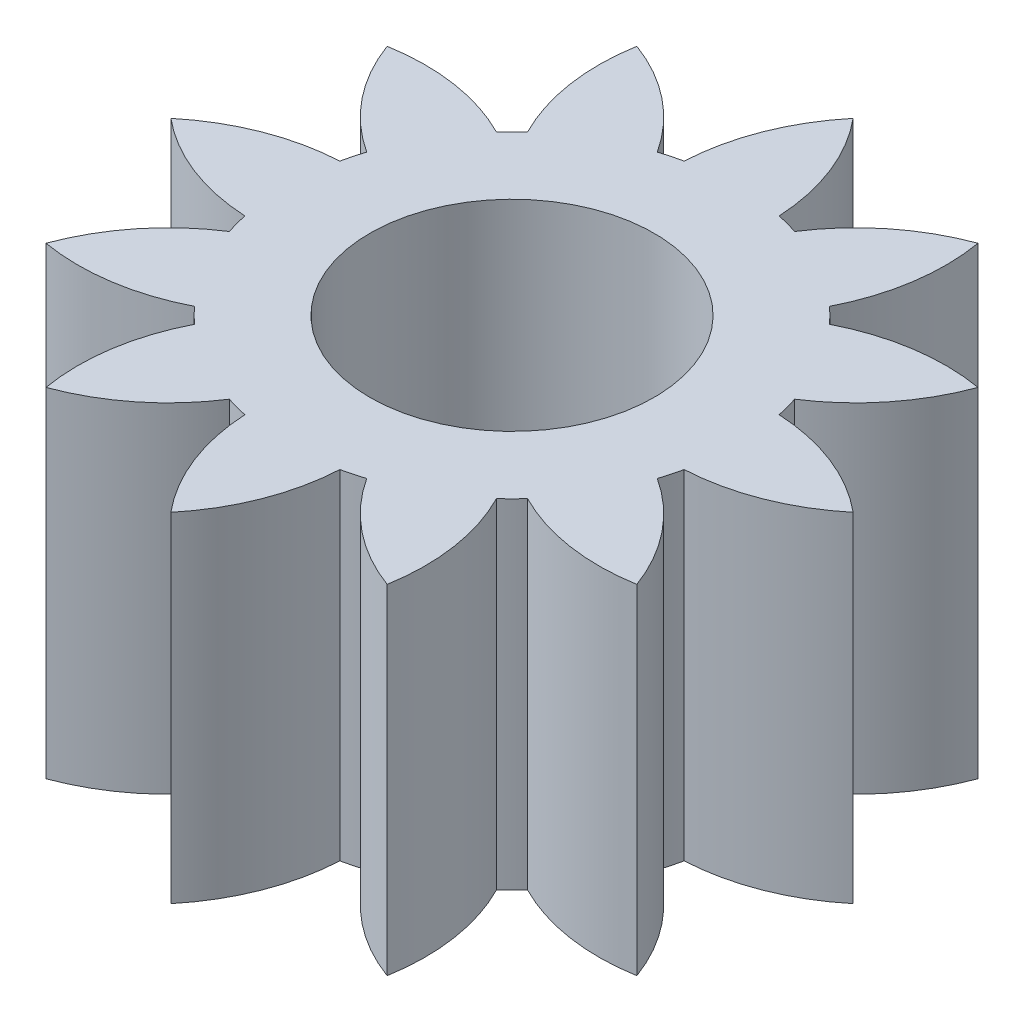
ISO-10303-21;
HEADER;
FILE_DESCRIPTION(('STEP AP214'),'2;1');
FILE_NAME('part.step','',(''),(''),'','','');
FILE_SCHEMA(('AUTOMOTIVE_DESIGN { 1 0 10303 214 1 1 1 1 }'));
ENDSEC;
DATA;
#1=APPLICATION_CONTEXT('core data for automotive mechanical design processes');
#2=APPLICATION_PROTOCOL_DEFINITION('international standard','automotive_design',2000,#1);
#3=PRODUCT_CONTEXT('',#1,'mechanical');
#4=PRODUCT('Part','Part','',(#3));
#5=PRODUCT_RELATED_PRODUCT_CATEGORY('part','',(#4));
#6=PRODUCT_DEFINITION_FORMATION('','',#4);
#7=PRODUCT_DEFINITION_CONTEXT('part definition',#1,'design');
#8=PRODUCT_DEFINITION('design','',#6,#7);
#9=PRODUCT_DEFINITION_SHAPE('','',#8);
#10=(LENGTH_UNIT() NAMED_UNIT(*) SI_UNIT(.MILLI.,.METRE.));
#11=(NAMED_UNIT(*) PLANE_ANGLE_UNIT() SI_UNIT($,.RADIAN.));
#12=(NAMED_UNIT(*) SI_UNIT($,.STERADIAN.) SOLID_ANGLE_UNIT());
#13=UNCERTAINTY_MEASURE_WITH_UNIT(LENGTH_MEASURE(1.E-05),#10,'distance_accuracy_value','');
#14=(GEOMETRIC_REPRESENTATION_CONTEXT(3) GLOBAL_UNCERTAINTY_ASSIGNED_CONTEXT((#13)) GLOBAL_UNIT_ASSIGNED_CONTEXT((#10,
#11,#12)) REPRESENTATION_CONTEXT('',''));
#15=CARTESIAN_POINT('',(0.,0.,0.));
#16=DIRECTION('',(0.,0.,1.));
#17=DIRECTION('',(1.,0.,0.));
#18=AXIS2_PLACEMENT_3D('',#15,#16,#17);
#19=CARTESIAN_POINT('',(0.,5.842,0.));
#20=DIRECTION('',(0.,-1.,0.));
#21=DIRECTION('',(0.,0.,-1.));
#22=AXIS2_PLACEMENT_3D('',#19,#20,#21);
#23=CYLINDRICAL_SURFACE('',#22,3.8735);
#24=DIRECTION('',(0.,-1.,0.));
#25=VECTOR('',#24,1.);
#26=CARTESIAN_POINT('',(-2.60173430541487,8.70671709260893,-2.86966563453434));
#27=LINE('',#26,#25);
#28=CARTESIAN_POINT('',(-2.60173430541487,5.842,-2.86966563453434));
#29=VERTEX_POINT('',#28);
#30=CARTESIAN_POINT('',(-2.60173430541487,0.,-2.86966563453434));
#31=VERTEX_POINT('',#30);
#32=EDGE_CURVE('E296',#29,#31,#27,.T.);
#33=ORIENTED_EDGE('',*,*,#32,.T.);
#34=CARTESIAN_POINT('',(0.,0.,0.));
#35=DIRECTION('',(0.,1.,0.));
#36=DIRECTION('',(0.,0.,1.));
#37=AXIS2_PLACEMENT_3D('',#34,#35,#36);
#38=CIRCLE('',#37,3.8735);
#39=CARTESIAN_POINT('',(-2.86966563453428,0.,-2.60173430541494));
#40=VERTEX_POINT('',#39);
#41=EDGE_CURVE('E661',#31,#40,#38,.T.);
#42=ORIENTED_EDGE('',*,*,#41,.T.);
#43=DIRECTION('',(0.,-1.,0.));
#44=VECTOR('',#43,1.);
#45=CARTESIAN_POINT('',(-2.86966563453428,8.70671709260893,-2.60173430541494));
#46=LINE('',#45,#44);
#47=CARTESIAN_POINT('',(-2.86966563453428,5.842,-2.60173430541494));
#48=VERTEX_POINT('',#47);
#49=EDGE_CURVE('E316',#48,#40,#46,.T.);
#50=ORIENTED_EDGE('',*,*,#49,.F.);
#51=CARTESIAN_POINT('',(0.,5.842,0.));
#52=DIRECTION('',(0.,1.,0.));
#53=DIRECTION('',(0.,0.,1.));
#54=AXIS2_PLACEMENT_3D('',#51,#52,#53);
#55=CIRCLE('',#54,3.8735);
#56=EDGE_CURVE('E53',#29,#48,#55,.T.);
#57=ORIENTED_EDGE('',*,*,#56,.F.);
#58=EDGE_LOOP('',(#33,#42,#50,#57));
#59=FACE_BOUND('',#58,.T.);
#60=ADVANCED_FACE('F43',(#59),#23,.T.);
#61=DIRECTION('',(0.,-1.,0.));
#62=VECTOR('',#61,1.);
#63=CARTESIAN_POINT('',(-1.1843361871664,8.70671709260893,-3.68800081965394));
#64=LINE('',#63,#62);
#65=CARTESIAN_POINT('',(-1.1843361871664,5.842,-3.68800081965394));
#66=VERTEX_POINT('',#65);
#67=CARTESIAN_POINT('',(-1.1843361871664,0.,-3.68800081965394));
#68=VERTEX_POINT('',#67);
#69=EDGE_CURVE('E68',#66,#68,#64,.T.);
#70=ORIENTED_EDGE('',*,*,#69,.F.);
#71=CARTESIAN_POINT('',(-0.818335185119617,5.842,-3.78607049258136));
#72=VERTEX_POINT('',#71);
#73=EDGE_CURVE('E11',#72,#66,#55,.T.);
#74=ORIENTED_EDGE('',*,*,#73,.F.);
#75=DIRECTION('',(0.,-1.,0.));
#76=VECTOR('',#75,1.);
#77=CARTESIAN_POINT('',(-0.818335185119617,8.70671709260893,-3.78607049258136));
#78=LINE('',#77,#76);
#79=CARTESIAN_POINT('',(-0.818335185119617,0.,-3.78607049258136));
#80=VERTEX_POINT('',#79);
#81=EDGE_CURVE('E584',#72,#80,#78,.T.);
#82=ORIENTED_EDGE('',*,*,#81,.T.);
#83=EDGE_CURVE('E47',#80,#68,#38,.T.);
#84=ORIENTED_EDGE('',*,*,#83,.T.);
#85=EDGE_LOOP('',(#70,#74,#82,#84));
#86=FACE_BOUND('',#85,.T.);
#87=ADVANCED_FACE('F632',(#86),#23,.T.);
#88=DIRECTION('',(0.,-1.,0.));
#89=VECTOR('',#88,1.);
#90=CARTESIAN_POINT('',(-3.68800081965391,8.70671709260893,-1.18433618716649));
#91=LINE('',#90,#89);
#92=CARTESIAN_POINT('',(-3.68800081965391,5.842,-1.18433618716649));
#93=VERTEX_POINT('',#92);
#94=CARTESIAN_POINT('',(-3.68800081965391,0.,-1.18433618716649));
#95=VERTEX_POINT('',#94);
#96=EDGE_CURVE('E320',#93,#95,#91,.T.);
#97=ORIENTED_EDGE('',*,*,#96,.T.);
#98=CARTESIAN_POINT('',(-3.78607049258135,0.,-0.818335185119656));
#99=VERTEX_POINT('',#98);
#100=EDGE_CURVE('E665',#95,#99,#38,.T.);
#101=ORIENTED_EDGE('',*,*,#100,.T.);
#102=DIRECTION('',(0.,-1.,0.));
#103=VECTOR('',#102,1.);
#104=CARTESIAN_POINT('',(-3.78607049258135,8.70671709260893,-0.818335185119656));
#105=LINE('',#104,#103);
#106=CARTESIAN_POINT('',(-3.78607049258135,5.842,-0.818335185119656));
#107=VERTEX_POINT('',#106);
#108=EDGE_CURVE('E343',#107,#99,#105,.T.);
#109=ORIENTED_EDGE('',*,*,#108,.F.);
#110=EDGE_CURVE('E731',#93,#107,#55,.T.);
#111=ORIENTED_EDGE('',*,*,#110,.F.);
#112=EDGE_LOOP('',(#97,#101,#109,#111));
#113=FACE_BOUND('',#112,.T.);
#114=ADVANCED_FACE('F636',(#113),#23,.T.);
#115=DIRECTION('',(0.,-1.,0.));
#116=VECTOR('',#115,1.);
#117=CARTESIAN_POINT('',(-3.78607049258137,8.70671709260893,0.818335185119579));
#118=LINE('',#117,#116);
#119=CARTESIAN_POINT('',(-3.78607049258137,5.842,0.818335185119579));
#120=VERTEX_POINT('',#119);
#121=CARTESIAN_POINT('',(-3.78607049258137,0.,0.818335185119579));
#122=VERTEX_POINT('',#121);
#123=EDGE_CURVE('E347',#120,#122,#118,.T.);
#124=ORIENTED_EDGE('',*,*,#123,.T.);
#125=CARTESIAN_POINT('',(-3.68800081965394,0.,1.18433618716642));
#126=VERTEX_POINT('',#125);
#127=EDGE_CURVE('E667',#122,#126,#38,.T.);
#128=ORIENTED_EDGE('',*,*,#127,.T.);
#129=DIRECTION('',(0.,-1.,0.));
#130=VECTOR('',#129,1.);
#131=CARTESIAN_POINT('',(-3.68800081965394,8.70671709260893,1.18433618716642));
#132=LINE('',#131,#130);
#133=CARTESIAN_POINT('',(-3.68800081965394,5.842,1.18433618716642));
#134=VERTEX_POINT('',#133);
#135=EDGE_CURVE('E370',#134,#126,#132,.T.);
#136=ORIENTED_EDGE('',*,*,#135,.F.);
#137=EDGE_CURVE('E733',#120,#134,#55,.T.);
#138=ORIENTED_EDGE('',*,*,#137,.F.);
#139=EDGE_LOOP('',(#124,#128,#136,#138));
#140=FACE_BOUND('',#139,.T.);
#141=ADVANCED_FACE('F801',(#140),#23,.T.);
#142=DIRECTION('',(0.,-1.,0.));
#143=VECTOR('',#142,1.);
#144=CARTESIAN_POINT('',(-2.86966563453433,8.70671709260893,2.60173430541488));
#145=LINE('',#144,#143);
#146=CARTESIAN_POINT('',(-2.86966563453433,5.842,2.60173430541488));
#147=VERTEX_POINT('',#146);
#148=CARTESIAN_POINT('',(-2.86966563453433,0.,2.60173430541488));
#149=VERTEX_POINT('',#148);
#150=EDGE_CURVE('E374',#147,#149,#145,.T.);
#151=ORIENTED_EDGE('',*,*,#150,.T.);
#152=CARTESIAN_POINT('',(-2.60173430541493,0.,2.86966563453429));
#153=VERTEX_POINT('',#152);
#154=EDGE_CURVE('E671',#149,#153,#38,.T.);
#155=ORIENTED_EDGE('',*,*,#154,.T.);
#156=DIRECTION('',(0.,-1.,0.));
#157=VECTOR('',#156,1.);
#158=CARTESIAN_POINT('',(-2.60173430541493,8.70671709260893,2.86966563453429));
#159=LINE('',#158,#157);
#160=CARTESIAN_POINT('',(-2.60173430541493,5.842,2.86966563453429));
#161=VERTEX_POINT('',#160);
#162=EDGE_CURVE('E397',#161,#153,#159,.T.);
#163=ORIENTED_EDGE('',*,*,#162,.F.);
#164=EDGE_CURVE('E735',#147,#161,#55,.T.);
#165=ORIENTED_EDGE('',*,*,#164,.F.);
#166=EDGE_LOOP('',(#151,#155,#163,#165));
#167=FACE_BOUND('',#166,.T.);
#168=ADVANCED_FACE('F791',(#167),#23,.T.);
#169=DIRECTION('',(0.,-1.,0.));
#170=VECTOR('',#169,1.);
#171=CARTESIAN_POINT('',(-1.18433618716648,8.70671709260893,3.68800081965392));
#172=LINE('',#171,#170);
#173=CARTESIAN_POINT('',(-1.18433618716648,5.842,3.68800081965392));
#174=VERTEX_POINT('',#173);
#175=CARTESIAN_POINT('',(-1.18433618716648,0.,3.68800081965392));
#176=VERTEX_POINT('',#175);
#177=EDGE_CURVE('E401',#174,#176,#172,.T.);
#178=ORIENTED_EDGE('',*,*,#177,.T.);
#179=CARTESIAN_POINT('',(-0.818335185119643,0.,3.78607049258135));
#180=VERTEX_POINT('',#179);
#181=EDGE_CURVE('E675',#176,#180,#38,.T.);
#182=ORIENTED_EDGE('',*,*,#181,.T.);
#183=DIRECTION('',(0.,-1.,0.));
#184=VECTOR('',#183,1.);
#185=CARTESIAN_POINT('',(-0.818335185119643,8.70671709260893,3.78607049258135));
#186=LINE('',#185,#184);
#187=CARTESIAN_POINT('',(-0.818335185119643,5.842,3.78607049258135));
#188=VERTEX_POINT('',#187);
#189=EDGE_CURVE('E424',#188,#180,#186,.T.);
#190=ORIENTED_EDGE('',*,*,#189,.F.);
#191=EDGE_CURVE('E737',#174,#188,#55,.T.);
#192=ORIENTED_EDGE('',*,*,#191,.F.);
#193=EDGE_LOOP('',(#178,#182,#190,#192));
#194=FACE_BOUND('',#193,.T.);
#195=ADVANCED_FACE('F781',(#194),#23,.T.);
#196=DIRECTION('',(0.,-1.,0.));
#197=VECTOR('',#196,1.);
#198=CARTESIAN_POINT('',(0.818335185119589,8.70671709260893,3.78607049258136));
#199=LINE('',#198,#197);
#200=CARTESIAN_POINT('',(0.818335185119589,5.842,3.78607049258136));
#201=VERTEX_POINT('',#200);
#202=CARTESIAN_POINT('',(0.818335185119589,0.,3.78607049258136));
#203=VERTEX_POINT('',#202);
#204=EDGE_CURVE('E428',#201,#203,#199,.T.);
#205=ORIENTED_EDGE('',*,*,#204,.T.);
#206=CARTESIAN_POINT('',(1.18433618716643,0.,3.68800081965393));
#207=VERTEX_POINT('',#206);
#208=EDGE_CURVE('E679',#203,#207,#38,.T.);
#209=ORIENTED_EDGE('',*,*,#208,.T.);
#210=DIRECTION('',(0.,-1.,0.));
#211=VECTOR('',#210,1.);
#212=CARTESIAN_POINT('',(1.18433618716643,8.70671709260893,3.68800081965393));
#213=LINE('',#212,#211);
#214=CARTESIAN_POINT('',(1.18433618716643,5.842,3.68800081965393));
#215=VERTEX_POINT('',#214);
#216=EDGE_CURVE('E451',#215,#207,#213,.T.);
#217=ORIENTED_EDGE('',*,*,#216,.F.);
#218=EDGE_CURVE('E739',#201,#215,#55,.T.);
#219=ORIENTED_EDGE('',*,*,#218,.F.);
#220=EDGE_LOOP('',(#205,#209,#217,#219));
#221=FACE_BOUND('',#220,.T.);
#222=ADVANCED_FACE('F771',(#221),#23,.T.);
#223=DIRECTION('',(0.,-1.,0.));
#224=VECTOR('',#223,1.);
#225=CARTESIAN_POINT('',(2.60173430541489,8.70671709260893,2.86966563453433));
#226=LINE('',#225,#224);
#227=CARTESIAN_POINT('',(2.60173430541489,5.842,2.86966563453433));
#228=VERTEX_POINT('',#227);
#229=CARTESIAN_POINT('',(2.60173430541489,0.,2.86966563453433));
#230=VERTEX_POINT('',#229);
#231=EDGE_CURVE('E455',#228,#230,#226,.T.);
#232=ORIENTED_EDGE('',*,*,#231,.T.);
#233=CARTESIAN_POINT('',(2.8696656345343,0.,2.60173430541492));
#234=VERTEX_POINT('',#233);
#235=EDGE_CURVE('E683',#230,#234,#38,.T.);
#236=ORIENTED_EDGE('',*,*,#235,.T.);
#237=DIRECTION('',(0.,-1.,0.));
#238=VECTOR('',#237,1.);
#239=CARTESIAN_POINT('',(2.8696656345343,8.70671709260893,2.60173430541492));
#240=LINE('',#239,#238);
#241=CARTESIAN_POINT('',(2.8696656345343,5.842,2.60173430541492));
#242=VERTEX_POINT('',#241);
#243=EDGE_CURVE('E478',#242,#234,#240,.T.);
#244=ORIENTED_EDGE('',*,*,#243,.F.);
#245=EDGE_CURVE('E713',#228,#242,#55,.T.);
#246=ORIENTED_EDGE('',*,*,#245,.F.);
#247=EDGE_LOOP('',(#232,#236,#244,#246));
#248=FACE_BOUND('',#247,.T.);
#249=ADVANCED_FACE('F745',(#248),#23,.T.);
#250=DIRECTION('',(0.,-1.,0.));
#251=VECTOR('',#250,1.);
#252=CARTESIAN_POINT('',(3.68800081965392,8.70671709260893,1.18433618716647));
#253=LINE('',#252,#251);
#254=CARTESIAN_POINT('',(3.68800081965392,5.842,1.18433618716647));
#255=VERTEX_POINT('',#254);
#256=CARTESIAN_POINT('',(3.68800081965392,0.,1.18433618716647));
#257=VERTEX_POINT('',#256);
#258=EDGE_CURVE('E482',#255,#257,#253,.T.);
#259=ORIENTED_EDGE('',*,*,#258,.T.);
#260=CARTESIAN_POINT('',(3.78607049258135,0.,0.818335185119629));
#261=VERTEX_POINT('',#260);
#262=EDGE_CURVE('E687',#257,#261,#38,.T.);
#263=ORIENTED_EDGE('',*,*,#262,.T.);
#264=DIRECTION('',(0.,-1.,0.));
#265=VECTOR('',#264,1.);
#266=CARTESIAN_POINT('',(3.78607049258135,8.70671709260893,0.81833518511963));
#267=LINE('',#266,#265);
#268=CARTESIAN_POINT('',(3.78607049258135,5.842,0.818335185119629));
#269=VERTEX_POINT('',#268);
#270=EDGE_CURVE('E505',#269,#261,#267,.T.);
#271=ORIENTED_EDGE('',*,*,#270,.F.);
#272=EDGE_CURVE('E710',#255,#269,#55,.T.);
#273=ORIENTED_EDGE('',*,*,#272,.F.);
#274=EDGE_LOOP('',(#259,#263,#271,#273));
#275=FACE_BOUND('',#274,.T.);
#276=ADVANCED_FACE('F755',(#275),#23,.T.);
#277=DIRECTION('',(0.,-1.,0.));
#278=VECTOR('',#277,1.);
#279=CARTESIAN_POINT('',(3.78607049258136,8.70671709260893,-0.818335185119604));
#280=LINE('',#279,#278);
#281=CARTESIAN_POINT('',(3.78607049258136,5.842,-0.818335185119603));
#282=VERTEX_POINT('',#281);
#283=CARTESIAN_POINT('',(3.78607049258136,0.,-0.818335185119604));
#284=VERTEX_POINT('',#283);
#285=EDGE_CURVE('E509',#282,#284,#280,.T.);
#286=ORIENTED_EDGE('',*,*,#285,.T.);
#287=CARTESIAN_POINT('',(3.68800081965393,0.,-1.18433618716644));
#288=VERTEX_POINT('',#287);
#289=EDGE_CURVE('E659',#284,#288,#38,.T.);
#290=ORIENTED_EDGE('',*,*,#289,.T.);
#291=DIRECTION('',(0.,-1.,0.));
#292=VECTOR('',#291,1.);
#293=CARTESIAN_POINT('',(3.68800081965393,8.70671709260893,-1.18433618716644));
#294=LINE('',#293,#292);
#295=CARTESIAN_POINT('',(3.68800081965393,5.842,-1.18433618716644));
#296=VERTEX_POINT('',#295);
#297=EDGE_CURVE('E532',#296,#288,#294,.T.);
#298=ORIENTED_EDGE('',*,*,#297,.F.);
#299=EDGE_CURVE('E707',#282,#296,#55,.T.);
#300=ORIENTED_EDGE('',*,*,#299,.F.);
#301=EDGE_LOOP('',(#286,#290,#298,#300));
#302=FACE_BOUND('',#301,.T.);
#303=ADVANCED_FACE('F644',(#302),#23,.T.);
#304=DIRECTION('',(0.,-1.,0.));
#305=VECTOR('',#304,1.);
#306=CARTESIAN_POINT('',(2.86966563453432,8.70671709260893,-2.6017343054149));
#307=LINE('',#306,#305);
#308=CARTESIAN_POINT('',(2.86966563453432,5.842,-2.6017343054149));
#309=VERTEX_POINT('',#308);
#310=CARTESIAN_POINT('',(2.86966563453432,0.,-2.6017343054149));
#311=VERTEX_POINT('',#310);
#312=EDGE_CURVE('E536',#309,#311,#307,.T.);
#313=ORIENTED_EDGE('',*,*,#312,.T.);
#314=CARTESIAN_POINT('',(2.60173430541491,0.,-2.86966563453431));
#315=VERTEX_POINT('',#314);
#316=EDGE_CURVE('E657',#311,#315,#38,.T.);
#317=ORIENTED_EDGE('',*,*,#316,.T.);
#318=DIRECTION('',(0.,-1.,0.));
#319=VECTOR('',#318,1.);
#320=CARTESIAN_POINT('',(2.60173430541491,8.70671709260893,-2.86966563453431));
#321=LINE('',#320,#319);
#322=CARTESIAN_POINT('',(2.60173430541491,5.842,-2.86966563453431));
#323=VERTEX_POINT('',#322);
#324=EDGE_CURVE('E559',#323,#315,#321,.T.);
#325=ORIENTED_EDGE('',*,*,#324,.F.);
#326=EDGE_CURVE('E664',#309,#323,#55,.T.);
#327=ORIENTED_EDGE('',*,*,#326,.F.);
#328=EDGE_LOOP('',(#313,#317,#325,#327));
#329=FACE_BOUND('',#328,.T.);
#330=ADVANCED_FACE('F638',(#329),#23,.T.);
#331=DIRECTION('',(0.,-1.,0.));
#332=VECTOR('',#331,1.);
#333=CARTESIAN_POINT('',(1.18433618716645,8.70671709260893,-3.68800081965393));
#334=LINE('',#333,#332);
#335=CARTESIAN_POINT('',(1.18433618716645,5.842,-3.68800081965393));
#336=VERTEX_POINT('',#335);
#337=CARTESIAN_POINT('',(1.18433618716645,0.,-3.68800081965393));
#338=VERTEX_POINT('',#337);
#339=EDGE_CURVE('E563',#336,#338,#334,.T.);
#340=ORIENTED_EDGE('',*,*,#339,.T.);
#341=CARTESIAN_POINT('',(0.818335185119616,0.,-3.78607049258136));
#342=VERTEX_POINT('',#341);
#343=EDGE_CURVE('E610',#338,#342,#38,.T.);
#344=ORIENTED_EDGE('',*,*,#343,.T.);
#345=DIRECTION('',(0.,-1.,0.));
#346=VECTOR('',#345,1.);
#347=CARTESIAN_POINT('',(0.818335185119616,8.70671709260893,-3.78607049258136));
#348=LINE('',#347,#346);
#349=CARTESIAN_POINT('',(0.818335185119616,5.842,-3.78607049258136));
#350=VERTEX_POINT('',#349);
#351=EDGE_CURVE('E557',#350,#342,#348,.T.);
#352=ORIENTED_EDGE('',*,*,#351,.F.);
#353=EDGE_CURVE('E54',#336,#350,#55,.T.);
#354=ORIENTED_EDGE('',*,*,#353,.F.);
#355=EDGE_LOOP('',(#340,#344,#352,#354));
#356=FACE_BOUND('',#355,.T.);
#357=ADVANCED_FACE('F45',(#356),#23,.T.);
#358=CARTESIAN_POINT('',(0.,5.842,0.));
#359=DIRECTION('',(0.,1.,0.));
#360=DIRECTION('',(0.,0.,1.));
#361=AXIS2_PLACEMENT_3D('',#358,#359,#360);
#362=PLANE('',#361);
#363=ORIENTED_EDGE('',*,*,#73,.T.);
#364=CARTESIAN_POINT('',(-4.1694580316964,5.842,-1.75559724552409));
#365=DIRECTION('',(0.,1.,0.));
#366=DIRECTION('',(0.,0.,1.));
#367=AXIS2_PLACEMENT_3D('',#364,#365,#366);
#368=CIRCLE('',#367,3.556);
#369=CARTESIAN_POINT('',(-2.94004999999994,5.842,-5.09231597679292));
#370=VERTEX_POINT('',#369);
#371=EDGE_CURVE('E283',#66,#370,#368,.T.);
#372=ORIENTED_EDGE('',*,*,#371,.T.);
#373=CARTESIAN_POINT('',(0.564337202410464,5.842,-4.48865519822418));
#374=DIRECTION('',(0.,1.,0.));
#375=DIRECTION('',(0.,0.,1.));
#376=AXIS2_PLACEMENT_3D('',#373,#374,#375);
#377=CIRCLE('',#376,3.556);
#378=EDGE_CURVE('E294',#370,#29,#377,.T.);
#379=ORIENTED_EDGE('',*,*,#378,.T.);
#380=ORIENTED_EDGE('',*,*,#56,.T.);
#381=CARTESIAN_POINT('',(-4.48865519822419,5.842,0.564337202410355));
#382=DIRECTION('',(0.,1.,0.));
#383=DIRECTION('',(0.,0.,1.));
#384=AXIS2_PLACEMENT_3D('',#381,#382,#383);
#385=CIRCLE('',#384,3.556);
#386=CARTESIAN_POINT('',(-5.09231597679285,5.842,-2.94005000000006));
#387=VERTEX_POINT('',#386);
#388=EDGE_CURVE('E325',#48,#387,#385,.T.);
#389=ORIENTED_EDGE('',*,*,#388,.T.);
#390=CARTESIAN_POINT('',(-1.75559724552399,5.842,-4.16945803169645));
#391=DIRECTION('',(0.,1.,0.));
#392=DIRECTION('',(0.,0.,1.));
#393=AXIS2_PLACEMENT_3D('',#390,#391,#392);
#394=CIRCLE('',#393,3.556);
#395=EDGE_CURVE('E290',#387,#93,#394,.T.);
#396=ORIENTED_EDGE('',*,*,#395,.T.);
#397=ORIENTED_EDGE('',*,*,#110,.T.);
#398=CARTESIAN_POINT('',(-3.60512082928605,5.842,2.73305795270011));
#399=DIRECTION('',(0.,1.,0.));
#400=DIRECTION('',(0.,0.,1.));
#401=AXIS2_PLACEMENT_3D('',#398,#399,#400);
#402=CIRCLE('',#401,3.556);
#403=CARTESIAN_POINT('',(-5.8801,5.842,0.));
#404=VERTEX_POINT('',#403);
#405=EDGE_CURVE('E352',#107,#404,#402,.T.);
#406=ORIENTED_EDGE('',*,*,#405,.T.);
#407=CARTESIAN_POINT('',(-3.60512082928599,5.842,-2.73305795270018));
#408=DIRECTION('',(0.,1.,0.));
#409=DIRECTION('',(0.,0.,1.));
#410=AXIS2_PLACEMENT_3D('',#407,#408,#409);
#411=CIRCLE('',#410,3.556);
#412=EDGE_CURVE('E314',#404,#120,#411,.T.);
#413=ORIENTED_EDGE('',*,*,#412,.T.);
#414=ORIENTED_EDGE('',*,*,#137,.T.);
#415=CARTESIAN_POINT('',(-1.75559724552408,5.842,4.16945803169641));
#416=DIRECTION('',(0.,1.,0.));
#417=DIRECTION('',(0.,0.,1.));
#418=AXIS2_PLACEMENT_3D('',#415,#416,#417);
#419=CIRCLE('',#418,3.556);
#420=CARTESIAN_POINT('',(-5.09231597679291,5.842,2.94004999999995));
#421=VERTEX_POINT('',#420);
#422=EDGE_CURVE('E379',#134,#421,#419,.T.);
#423=ORIENTED_EDGE('',*,*,#422,.T.);
#424=CARTESIAN_POINT('',(-4.48865519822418,5.842,-0.564337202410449));
#425=DIRECTION('',(0.,1.,0.));
#426=DIRECTION('',(0.,0.,1.));
#427=AXIS2_PLACEMENT_3D('',#424,#425,#426);
#428=CIRCLE('',#427,3.556);
#429=EDGE_CURVE('E341',#421,#147,#428,.T.);
#430=ORIENTED_EDGE('',*,*,#429,.T.);
#431=ORIENTED_EDGE('',*,*,#164,.T.);
#432=CARTESIAN_POINT('',(0.56433720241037,5.842,4.48865519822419));
#433=DIRECTION('',(0.,1.,0.));
#434=DIRECTION('',(0.,0.,1.));
#435=AXIS2_PLACEMENT_3D('',#432,#433,#434);
#436=CIRCLE('',#435,3.556);
#437=CARTESIAN_POINT('',(-2.94005000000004,5.842,5.09231597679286));
#438=VERTEX_POINT('',#437);
#439=EDGE_CURVE('E406',#161,#438,#436,.T.);
#440=ORIENTED_EDGE('',*,*,#439,.T.);
#441=CARTESIAN_POINT('',(-4.16945803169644,5.842,1.755597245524));
#442=DIRECTION('',(0.,1.,0.));
#443=DIRECTION('',(0.,0.,1.));
#444=AXIS2_PLACEMENT_3D('',#441,#442,#443);
#445=CIRCLE('',#444,3.556);
#446=EDGE_CURVE('E368',#438,#174,#445,.T.);
#447=ORIENTED_EDGE('',*,*,#446,.T.);
#448=ORIENTED_EDGE('',*,*,#191,.T.);
#449=CARTESIAN_POINT('',(2.73305795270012,5.842,3.60512082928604));
#450=DIRECTION('',(0.,1.,0.));
#451=DIRECTION('',(0.,0.,1.));
#452=AXIS2_PLACEMENT_3D('',#449,#450,#451);
#453=CIRCLE('',#452,3.556);
#454=CARTESIAN_POINT('',(0.,5.842,5.8801));
#455=VERTEX_POINT('',#454);
#456=EDGE_CURVE('E433',#188,#455,#453,.T.);
#457=ORIENTED_EDGE('',*,*,#456,.T.);
#458=CARTESIAN_POINT('',(-2.73305795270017,5.842,3.605120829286));
#459=DIRECTION('',(0.,1.,0.));
#460=DIRECTION('',(0.,0.,1.));
#461=AXIS2_PLACEMENT_3D('',#458,#459,#460);
#462=CIRCLE('',#461,3.556);
#463=EDGE_CURVE('E395',#455,#201,#462,.T.);
#464=ORIENTED_EDGE('',*,*,#463,.T.);
#465=ORIENTED_EDGE('',*,*,#218,.T.);
#466=CARTESIAN_POINT('',(4.16945803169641,5.842,1.75559724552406));
#467=DIRECTION('',(0.,1.,0.));
#468=DIRECTION('',(0.,0.,1.));
#469=AXIS2_PLACEMENT_3D('',#466,#467,#468);
#470=CIRCLE('',#469,3.556);
#471=CARTESIAN_POINT('',(2.94004999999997,5.842,5.0923159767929));
#472=VERTEX_POINT('',#471);
#473=EDGE_CURVE('E460',#215,#472,#470,.T.);
#474=ORIENTED_EDGE('',*,*,#473,.T.);
#475=CARTESIAN_POINT('',(-0.564337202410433,5.842,4.48865519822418));
#476=DIRECTION('',(0.,1.,0.));
#477=DIRECTION('',(0.,0.,1.));
#478=AXIS2_PLACEMENT_3D('',#475,#476,#477);
#479=CIRCLE('',#478,3.556);
#480=EDGE_CURVE('E422',#472,#228,#479,.T.);
#481=ORIENTED_EDGE('',*,*,#480,.T.);
#482=ORIENTED_EDGE('',*,*,#245,.T.);
#483=CARTESIAN_POINT('',(4.48865519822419,5.842,-0.564337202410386));
#484=DIRECTION('',(0.,1.,0.));
#485=DIRECTION('',(0.,0.,1.));
#486=AXIS2_PLACEMENT_3D('',#483,#484,#485);
#487=CIRCLE('',#486,3.556);
#488=CARTESIAN_POINT('',(5.09231597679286,5.842,2.94005000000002));
#489=VERTEX_POINT('',#488);
#490=EDGE_CURVE('E487',#242,#489,#487,.T.);
#491=ORIENTED_EDGE('',*,*,#490,.T.);
#492=CARTESIAN_POINT('',(1.75559724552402,5.842,4.16945803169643));
#493=DIRECTION('',(0.,1.,0.));
#494=DIRECTION('',(0.,0.,1.));
#495=AXIS2_PLACEMENT_3D('',#492,#493,#494);
#496=CIRCLE('',#495,3.556);
#497=EDGE_CURVE('E449',#489,#255,#496,.T.);
#498=ORIENTED_EDGE('',*,*,#497,.T.);
#499=ORIENTED_EDGE('',*,*,#272,.T.);
#500=CARTESIAN_POINT('',(3.60512082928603,5.842,-2.73305795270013));
#501=DIRECTION('',(0.,1.,0.));
#502=DIRECTION('',(0.,0.,1.));
#503=AXIS2_PLACEMENT_3D('',#500,#501,#502);
#504=CIRCLE('',#503,3.556);
#505=CARTESIAN_POINT('',(5.8801,5.842,0.));
#506=VERTEX_POINT('',#505);
#507=EDGE_CURVE('E514',#269,#506,#504,.T.);
#508=ORIENTED_EDGE('',*,*,#507,.T.);
#509=CARTESIAN_POINT('',(3.60512082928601,5.842,2.73305795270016));
#510=DIRECTION('',(0.,1.,0.));
#511=DIRECTION('',(0.,0.,1.));
#512=AXIS2_PLACEMENT_3D('',#509,#510,#511);
#513=CIRCLE('',#512,3.556);
#514=EDGE_CURVE('E476',#506,#282,#513,.T.);
#515=ORIENTED_EDGE('',*,*,#514,.T.);
#516=ORIENTED_EDGE('',*,*,#299,.T.);
#517=CARTESIAN_POINT('',(1.75559724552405,5.842,-4.16945803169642));
#518=DIRECTION('',(0.,1.,0.));
#519=DIRECTION('',(0.,0.,1.));
#520=AXIS2_PLACEMENT_3D('',#517,#518,#519);
#521=CIRCLE('',#520,3.556);
#522=CARTESIAN_POINT('',(5.09231597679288,5.842,-2.94004999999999));
#523=VERTEX_POINT('',#522);
#524=EDGE_CURVE('E541',#296,#523,#521,.T.);
#525=ORIENTED_EDGE('',*,*,#524,.T.);
#526=CARTESIAN_POINT('',(4.48865519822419,5.842,0.564337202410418));
#527=DIRECTION('',(0.,1.,0.));
#528=DIRECTION('',(0.,0.,1.));
#529=AXIS2_PLACEMENT_3D('',#526,#527,#528);
#530=CIRCLE('',#529,3.556);
#531=EDGE_CURVE('E503',#523,#309,#530,.T.);
#532=ORIENTED_EDGE('',*,*,#531,.T.);
#533=ORIENTED_EDGE('',*,*,#326,.T.);
#534=CARTESIAN_POINT('',(-0.564337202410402,5.842,-4.48865519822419));
#535=DIRECTION('',(0.,1.,0.));
#536=DIRECTION('',(0.,0.,1.));
#537=AXIS2_PLACEMENT_3D('',#534,#535,#536);
#538=CIRCLE('',#537,3.556);
#539=CARTESIAN_POINT('',(2.94005000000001,5.842,-5.09231597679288));
#540=VERTEX_POINT('',#539);
#541=EDGE_CURVE('E568',#323,#540,#538,.T.);
#542=ORIENTED_EDGE('',*,*,#541,.T.);
#543=CARTESIAN_POINT('',(4.16945803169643,5.842,-1.75559724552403));
#544=DIRECTION('',(0.,1.,0.));
#545=DIRECTION('',(0.,0.,1.));
#546=AXIS2_PLACEMENT_3D('',#543,#544,#545);
#547=CIRCLE('',#546,3.556);
#548=EDGE_CURVE('E530',#540,#336,#547,.T.);
#549=ORIENTED_EDGE('',*,*,#548,.T.);
#550=ORIENTED_EDGE('',*,*,#353,.T.);
#551=CARTESIAN_POINT('',(-2.73305795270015,5.842,-3.60512082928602));
#552=DIRECTION('',(0.,1.,0.));
#553=DIRECTION('',(0.,0.,1.));
#554=AXIS2_PLACEMENT_3D('',#551,#552,#553);
#555=CIRCLE('',#554,3.556);
#556=CARTESIAN_POINT('',(0.,5.842,-5.8801));
#557=VERTEX_POINT('',#556);
#558=EDGE_CURVE('E594',#350,#557,#555,.T.);
#559=ORIENTED_EDGE('',*,*,#558,.T.);
#560=CARTESIAN_POINT('',(2.73305795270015,5.842,-3.60512082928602));
#561=DIRECTION('',(0.,1.,0.));
#562=DIRECTION('',(0.,0.,1.));
#563=AXIS2_PLACEMENT_3D('',#560,#561,#562);
#564=CIRCLE('',#563,3.556);
#565=EDGE_CURVE('E590',#557,#72,#564,.T.);
#566=ORIENTED_EDGE('',*,*,#565,.T.);
#567=EDGE_LOOP('',(#363,#372,#379,#380,#389,#396,#397,#406,#413,#414,#423,#430,#431,#440,#447,
#448,#457,#464,#465,#474,#481,#482,#491,#498,#499,#508,#515,#516,#525,#532,#533,#542,#549,#550,
#559,#566));
#568=FACE_BOUND('',#567,.T.);
#569=CARTESIAN_POINT('',(0.,5.842,0.));
#570=DIRECTION('',(0.,1.,0.));
#571=DIRECTION('',(0.,0.,1.));
#572=AXIS2_PLACEMENT_3D('',#569,#570,#571);
#573=CIRCLE('',#572,2.4511);
#574=CARTESIAN_POINT('',(0.,5.842,2.4511));
#575=VERTEX_POINT('',#574);
#576=EDGE_CURVE('E606',#575,#575,#573,.T.);
#577=ORIENTED_EDGE('',*,*,#576,.F.);
#578=EDGE_LOOP('',(#577));
#579=FACE_BOUND('',#578,.T.);
#580=ADVANCED_FACE('F300',(#568,#579),#362,.T.);
#581=CARTESIAN_POINT('',(0.,0.,0.));
#582=DIRECTION('',(0.,1.,0.));
#583=DIRECTION('',(0.,0.,1.));
#584=AXIS2_PLACEMENT_3D('',#581,#582,#583);
#585=PLANE('',#584);
#586=ORIENTED_EDGE('',*,*,#83,.F.);
#587=CARTESIAN_POINT('',(2.73305795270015,0.,-3.60512082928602));
#588=DIRECTION('',(0.,1.,0.));
#589=DIRECTION('',(0.,0.,1.));
#590=AXIS2_PLACEMENT_3D('',#587,#588,#589);
#591=CIRCLE('',#590,3.556);
#592=CARTESIAN_POINT('',(0.,0.,-5.8801));
#593=VERTEX_POINT('',#592);
#594=EDGE_CURVE('E581',#593,#80,#591,.T.);
#595=ORIENTED_EDGE('',*,*,#594,.F.);
#596=CARTESIAN_POINT('',(-2.73305795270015,0.,-3.60512082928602));
#597=DIRECTION('',(0.,1.,0.));
#598=DIRECTION('',(0.,0.,-1.));
#599=AXIS2_PLACEMENT_3D('',#596,#597,#598);
#600=CIRCLE('',#599,3.556);
#601=EDGE_CURVE('E586',#342,#593,#600,.T.);
#602=ORIENTED_EDGE('',*,*,#601,.F.);
#603=ORIENTED_EDGE('',*,*,#343,.F.);
#604=CARTESIAN_POINT('',(4.16945803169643,0.,-1.75559724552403));
#605=DIRECTION('',(0.,1.,0.));
#606=DIRECTION('',(0.,0.,1.));
#607=AXIS2_PLACEMENT_3D('',#604,#605,#606);
#608=CIRCLE('',#607,3.556);
#609=CARTESIAN_POINT('',(2.94005000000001,0.,-5.09231597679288));
#610=VERTEX_POINT('',#609);
#611=EDGE_CURVE('E558',#610,#338,#608,.T.);
#612=ORIENTED_EDGE('',*,*,#611,.F.);
#613=CARTESIAN_POINT('',(-0.564337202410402,0.,-4.48865519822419));
#614=DIRECTION('',(0.,1.,0.));
#615=DIRECTION('',(0.,0.,-1.));
#616=AXIS2_PLACEMENT_3D('',#613,#614,#615);
#617=CIRCLE('',#616,3.556);
#618=EDGE_CURVE('E564',#315,#610,#617,.T.);
#619=ORIENTED_EDGE('',*,*,#618,.F.);
#620=ORIENTED_EDGE('',*,*,#316,.F.);
#621=CARTESIAN_POINT('',(4.48865519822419,0.,0.564337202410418));
#622=DIRECTION('',(0.,1.,0.));
#623=DIRECTION('',(0.,0.,1.));
#624=AXIS2_PLACEMENT_3D('',#621,#622,#623);
#625=CIRCLE('',#624,3.556);
#626=CARTESIAN_POINT('',(5.09231597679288,0.,-2.94004999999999));
#627=VERTEX_POINT('',#626);
#628=EDGE_CURVE('E531',#627,#311,#625,.T.);
#629=ORIENTED_EDGE('',*,*,#628,.F.);
#630=CARTESIAN_POINT('',(1.75559724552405,0.,-4.16945803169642));
#631=DIRECTION('',(0.,1.,0.));
#632=DIRECTION('',(0.,0.,-1.));
#633=AXIS2_PLACEMENT_3D('',#630,#631,#632);
#634=CIRCLE('',#633,3.556);
#635=EDGE_CURVE('E537',#288,#627,#634,.T.);
#636=ORIENTED_EDGE('',*,*,#635,.F.);
#637=ORIENTED_EDGE('',*,*,#289,.F.);
#638=CARTESIAN_POINT('',(3.60512082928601,0.,2.73305795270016));
#639=DIRECTION('',(0.,1.,0.));
#640=DIRECTION('',(0.,0.,1.));
#641=AXIS2_PLACEMENT_3D('',#638,#639,#640);
#642=CIRCLE('',#641,3.556);
#643=CARTESIAN_POINT('',(5.8801,0.,0.));
#644=VERTEX_POINT('',#643);
#645=EDGE_CURVE('E504',#644,#284,#642,.T.);
#646=ORIENTED_EDGE('',*,*,#645,.F.);
#647=CARTESIAN_POINT('',(3.60512082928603,0.,-2.73305795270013));
#648=DIRECTION('',(0.,1.,0.));
#649=DIRECTION('',(0.,0.,-1.));
#650=AXIS2_PLACEMENT_3D('',#647,#648,#649);
#651=CIRCLE('',#650,3.556);
#652=EDGE_CURVE('E510',#261,#644,#651,.T.);
#653=ORIENTED_EDGE('',*,*,#652,.F.);
#654=ORIENTED_EDGE('',*,*,#262,.F.);
#655=CARTESIAN_POINT('',(1.75559724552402,0.,4.16945803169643));
#656=DIRECTION('',(0.,1.,0.));
#657=DIRECTION('',(0.,0.,1.));
#658=AXIS2_PLACEMENT_3D('',#655,#656,#657);
#659=CIRCLE('',#658,3.556);
#660=CARTESIAN_POINT('',(5.09231597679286,0.,2.94005000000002));
#661=VERTEX_POINT('',#660);
#662=EDGE_CURVE('E477',#661,#257,#659,.T.);
#663=ORIENTED_EDGE('',*,*,#662,.F.);
#664=CARTESIAN_POINT('',(4.48865519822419,0.,-0.564337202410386));
#665=DIRECTION('',(0.,1.,0.));
#666=DIRECTION('',(0.,0.,-1.));
#667=AXIS2_PLACEMENT_3D('',#664,#665,#666);
#668=CIRCLE('',#667,3.556);
#669=EDGE_CURVE('E483',#234,#661,#668,.T.);
#670=ORIENTED_EDGE('',*,*,#669,.F.);
#671=ORIENTED_EDGE('',*,*,#235,.F.);
#672=CARTESIAN_POINT('',(-0.564337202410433,0.,4.48865519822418));
#673=DIRECTION('',(0.,1.,0.));
#674=DIRECTION('',(0.,0.,1.));
#675=AXIS2_PLACEMENT_3D('',#672,#673,#674);
#676=CIRCLE('',#675,3.556);
#677=CARTESIAN_POINT('',(2.94004999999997,0.,5.09231597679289));
#678=VERTEX_POINT('',#677);
#679=EDGE_CURVE('E450',#678,#230,#676,.T.);
#680=ORIENTED_EDGE('',*,*,#679,.F.);
#681=CARTESIAN_POINT('',(4.16945803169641,0.,1.75559724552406));
#682=DIRECTION('',(0.,1.,0.));
#683=DIRECTION('',(0.,0.,-1.));
#684=AXIS2_PLACEMENT_3D('',#681,#682,#683);
#685=CIRCLE('',#684,3.556);
#686=EDGE_CURVE('E456',#207,#678,#685,.T.);
#687=ORIENTED_EDGE('',*,*,#686,.F.);
#688=ORIENTED_EDGE('',*,*,#208,.F.);
#689=CARTESIAN_POINT('',(-2.73305795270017,0.,3.605120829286));
#690=DIRECTION('',(0.,1.,0.));
#691=DIRECTION('',(0.,0.,1.));
#692=AXIS2_PLACEMENT_3D('',#689,#690,#691);
#693=CIRCLE('',#692,3.556);
#694=CARTESIAN_POINT('',(0.,0.,5.8801));
#695=VERTEX_POINT('',#694);
#696=EDGE_CURVE('E423',#695,#203,#693,.T.);
#697=ORIENTED_EDGE('',*,*,#696,.F.);
#698=CARTESIAN_POINT('',(2.73305795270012,0.,3.60512082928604));
#699=DIRECTION('',(0.,1.,0.));
#700=DIRECTION('',(0.,0.,-1.));
#701=AXIS2_PLACEMENT_3D('',#698,#699,#700);
#702=CIRCLE('',#701,3.556);
#703=EDGE_CURVE('E429',#180,#695,#702,.T.);
#704=ORIENTED_EDGE('',*,*,#703,.F.);
#705=ORIENTED_EDGE('',*,*,#181,.F.);
#706=CARTESIAN_POINT('',(-4.16945803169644,0.,1.755597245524));
#707=DIRECTION('',(0.,1.,0.));
#708=DIRECTION('',(0.,0.,1.));
#709=AXIS2_PLACEMENT_3D('',#706,#707,#708);
#710=CIRCLE('',#709,3.556);
#711=CARTESIAN_POINT('',(-2.94005000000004,0.,5.09231597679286));
#712=VERTEX_POINT('',#711);
#713=EDGE_CURVE('E396',#712,#176,#710,.T.);
#714=ORIENTED_EDGE('',*,*,#713,.F.);
#715=CARTESIAN_POINT('',(0.56433720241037,0.,4.48865519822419));
#716=DIRECTION('',(0.,1.,0.));
#717=DIRECTION('',(0.,0.,-1.));
#718=AXIS2_PLACEMENT_3D('',#715,#716,#717);
#719=CIRCLE('',#718,3.556);
#720=EDGE_CURVE('E402',#153,#712,#719,.T.);
#721=ORIENTED_EDGE('',*,*,#720,.F.);
#722=ORIENTED_EDGE('',*,*,#154,.F.);
#723=CARTESIAN_POINT('',(-4.48865519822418,0.,-0.564337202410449));
#724=DIRECTION('',(0.,1.,0.));
#725=DIRECTION('',(0.,0.,1.));
#726=AXIS2_PLACEMENT_3D('',#723,#724,#725);
#727=CIRCLE('',#726,3.556);
#728=CARTESIAN_POINT('',(-5.09231597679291,0.,2.94004999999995));
#729=VERTEX_POINT('',#728);
#730=EDGE_CURVE('E369',#729,#149,#727,.T.);
#731=ORIENTED_EDGE('',*,*,#730,.F.);
#732=CARTESIAN_POINT('',(-1.75559724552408,0.,4.16945803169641));
#733=DIRECTION('',(0.,1.,0.));
#734=DIRECTION('',(0.,0.,-1.));
#735=AXIS2_PLACEMENT_3D('',#732,#733,#734);
#736=CIRCLE('',#735,3.556);
#737=EDGE_CURVE('E375',#126,#729,#736,.T.);
#738=ORIENTED_EDGE('',*,*,#737,.F.);
#739=ORIENTED_EDGE('',*,*,#127,.F.);
#740=CARTESIAN_POINT('',(-3.60512082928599,0.,-2.73305795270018));
#741=DIRECTION('',(0.,1.,0.));
#742=DIRECTION('',(0.,0.,1.));
#743=AXIS2_PLACEMENT_3D('',#740,#741,#742);
#744=CIRCLE('',#743,3.556);
#745=CARTESIAN_POINT('',(-5.8801,0.,0.));
#746=VERTEX_POINT('',#745);
#747=EDGE_CURVE('E342',#746,#122,#744,.T.);
#748=ORIENTED_EDGE('',*,*,#747,.F.);
#749=CARTESIAN_POINT('',(-3.60512082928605,0.,2.73305795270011));
#750=DIRECTION('',(0.,1.,0.));
#751=DIRECTION('',(0.,0.,-1.));
#752=AXIS2_PLACEMENT_3D('',#749,#750,#751);
#753=CIRCLE('',#752,3.556);
#754=EDGE_CURVE('E348',#99,#746,#753,.T.);
#755=ORIENTED_EDGE('',*,*,#754,.F.);
#756=ORIENTED_EDGE('',*,*,#100,.F.);
#757=CARTESIAN_POINT('',(-1.75559724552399,0.,-4.16945803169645));
#758=DIRECTION('',(0.,1.,0.));
#759=DIRECTION('',(0.,0.,1.));
#760=AXIS2_PLACEMENT_3D('',#757,#758,#759);
#761=CIRCLE('',#760,3.556);
#762=CARTESIAN_POINT('',(-5.09231597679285,0.,-2.94005000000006));
#763=VERTEX_POINT('',#762);
#764=EDGE_CURVE('E315',#763,#95,#761,.T.);
#765=ORIENTED_EDGE('',*,*,#764,.F.);
#766=CARTESIAN_POINT('',(-4.48865519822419,0.,0.564337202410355));
#767=DIRECTION('',(0.,1.,0.));
#768=DIRECTION('',(0.,0.,-1.));
#769=AXIS2_PLACEMENT_3D('',#766,#767,#768);
#770=CIRCLE('',#769,3.556);
#771=EDGE_CURVE('E321',#40,#763,#770,.T.);
#772=ORIENTED_EDGE('',*,*,#771,.F.);
#773=ORIENTED_EDGE('',*,*,#41,.F.);
#774=CARTESIAN_POINT('',(0.564337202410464,0.,-4.48865519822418));
#775=DIRECTION('',(0.,1.,0.));
#776=DIRECTION('',(0.,0.,1.));
#777=AXIS2_PLACEMENT_3D('',#774,#775,#776);
#778=CIRCLE('',#777,3.556);
#779=CARTESIAN_POINT('',(-2.94004999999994,0.,-5.09231597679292));
#780=VERTEX_POINT('',#779);
#781=EDGE_CURVE('E291',#780,#31,#778,.T.);
#782=ORIENTED_EDGE('',*,*,#781,.F.);
#783=CARTESIAN_POINT('',(-4.1694580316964,0.,-1.75559724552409));
#784=DIRECTION('',(0.,1.,0.));
#785=DIRECTION('',(0.,0.,-1.));
#786=AXIS2_PLACEMENT_3D('',#783,#784,#785);
#787=CIRCLE('',#786,3.556);
#788=EDGE_CURVE('E285',#68,#780,#787,.T.);
#789=ORIENTED_EDGE('',*,*,#788,.F.);
#790=EDGE_LOOP('',(#586,#595,#602,#603,#612,#619,#620,#629,#636,#637,#646,#653,#654,#663,#670,
#671,#680,#687,#688,#697,#704,#705,#714,#721,#722,#731,#738,#739,#748,#755,#756,#765,#772,#773,
#782,#789));
#791=FACE_BOUND('',#790,.T.);
#792=CARTESIAN_POINT('',(0.,0.,0.));
#793=DIRECTION('',(0.,1.,0.));
#794=DIRECTION('',(0.,0.,1.));
#795=AXIS2_PLACEMENT_3D('',#792,#793,#794);
#796=CIRCLE('',#795,2.4511);
#797=CARTESIAN_POINT('',(0.,0.,2.4511));
#798=VERTEX_POINT('',#797);
#799=EDGE_CURVE('E593',#798,#798,#796,.T.);
#800=ORIENTED_EDGE('',*,*,#799,.T.);
#801=EDGE_LOOP('',(#800));
#802=FACE_BOUND('',#801,.T.);
#803=ADVANCED_FACE('F615',(#791,#802),#585,.F.);
#804=CARTESIAN_POINT('',(0.,5.842,0.));
#805=DIRECTION('',(0.,-1.,0.));
#806=DIRECTION('',(0.,0.,-1.));
#807=AXIS2_PLACEMENT_3D('',#804,#805,#806);
#808=CYLINDRICAL_SURFACE('',#807,2.4511);
#809=ORIENTED_EDGE('',*,*,#576,.T.);
#810=EDGE_LOOP('',(#809));
#811=FACE_BOUND('',#810,.T.);
#812=ORIENTED_EDGE('',*,*,#799,.F.);
#813=EDGE_LOOP('',(#812));
#814=FACE_BOUND('',#813,.T.);
#815=ADVANCED_FACE('F617',(#811,#814),#808,.F.);
#816=CARTESIAN_POINT('',(-2.73305795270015,8.70671709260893,-3.60512082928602));
#817=DIRECTION('',(0.,-1.,0.));
#818=DIRECTION('',(0.,0.,-1.));
#819=AXIS2_PLACEMENT_3D('',#816,#817,#818);
#820=CYLINDRICAL_SURFACE('',#819,3.556);
#821=ORIENTED_EDGE('',*,*,#558,.F.);
#822=ORIENTED_EDGE('',*,*,#351,.T.);
#823=ORIENTED_EDGE('',*,*,#601,.T.);
#824=DIRECTION('',(0.,-1.,0.));
#825=VECTOR('',#824,1.);
#826=CARTESIAN_POINT('',(0.,8.70671709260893,-5.8801));
#827=LINE('',#826,#825);
#828=EDGE_CURVE('E585',#557,#593,#827,.T.);
#829=ORIENTED_EDGE('',*,*,#828,.F.);
#830=EDGE_LOOP('',(#821,#822,#823,#829));
#831=FACE_BOUND('',#830,.T.);
#832=ADVANCED_FACE('F619',(#831),#820,.T.);
#833=CARTESIAN_POINT('',(2.73305795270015,8.70671709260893,-3.60512082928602));
#834=DIRECTION('',(0.,-1.,0.));
#835=DIRECTION('',(0.,0.,-1.));
#836=AXIS2_PLACEMENT_3D('',#833,#834,#835);
#837=CYLINDRICAL_SURFACE('',#836,3.556);
#838=ORIENTED_EDGE('',*,*,#565,.F.);
#839=ORIENTED_EDGE('',*,*,#828,.T.);
#840=ORIENTED_EDGE('',*,*,#594,.T.);
#841=ORIENTED_EDGE('',*,*,#81,.F.);
#842=EDGE_LOOP('',(#838,#839,#840,#841));
#843=FACE_BOUND('',#842,.T.);
#844=ADVANCED_FACE('F626',(#843),#837,.T.);
#845=CARTESIAN_POINT('',(4.16945803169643,8.70671709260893,-1.75559724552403));
#846=DIRECTION('',(0.,-1.,0.));
#847=DIRECTION('',(0.,0.,-1.));
#848=AXIS2_PLACEMENT_3D('',#845,#846,#847);
#849=CYLINDRICAL_SURFACE('',#848,3.556);
#850=ORIENTED_EDGE('',*,*,#548,.F.);
#851=DIRECTION('',(0.,-1.,0.));
#852=VECTOR('',#851,1.);
#853=CARTESIAN_POINT('',(2.94005000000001,8.70671709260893,-5.09231597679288));
#854=LINE('',#853,#852);
#855=EDGE_CURVE('E554',#540,#610,#854,.T.);
#856=ORIENTED_EDGE('',*,*,#855,.T.);
#857=ORIENTED_EDGE('',*,*,#611,.T.);
#858=ORIENTED_EDGE('',*,*,#339,.F.);
#859=EDGE_LOOP('',(#850,#856,#857,#858));
#860=FACE_BOUND('',#859,.T.);
#861=ADVANCED_FACE('F651',(#860),#849,.T.);
#862=CARTESIAN_POINT('',(-0.564337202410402,8.70671709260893,-4.48865519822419));
#863=DIRECTION('',(0.,-1.,0.));
#864=DIRECTION('',(0.,0.,-1.));
#865=AXIS2_PLACEMENT_3D('',#862,#863,#864);
#866=CYLINDRICAL_SURFACE('',#865,3.556);
#867=ORIENTED_EDGE('',*,*,#541,.F.);
#868=ORIENTED_EDGE('',*,*,#324,.T.);
#869=ORIENTED_EDGE('',*,*,#618,.T.);
#870=ORIENTED_EDGE('',*,*,#855,.F.);
#871=EDGE_LOOP('',(#867,#868,#869,#870));
#872=FACE_BOUND('',#871,.T.);
#873=ADVANCED_FACE('F717',(#872),#866,.T.);
#874=CARTESIAN_POINT('',(4.48865519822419,8.70671709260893,0.564337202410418));
#875=DIRECTION('',(0.,-1.,0.));
#876=DIRECTION('',(0.,0.,-1.));
#877=AXIS2_PLACEMENT_3D('',#874,#875,#876);
#878=CYLINDRICAL_SURFACE('',#877,3.556);
#879=ORIENTED_EDGE('',*,*,#531,.F.);
#880=DIRECTION('',(0.,-1.,0.));
#881=VECTOR('',#880,1.);
#882=CARTESIAN_POINT('',(5.09231597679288,8.70671709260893,-2.94004999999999));
#883=LINE('',#882,#881);
#884=EDGE_CURVE('E527',#523,#627,#883,.T.);
#885=ORIENTED_EDGE('',*,*,#884,.T.);
#886=ORIENTED_EDGE('',*,*,#628,.T.);
#887=ORIENTED_EDGE('',*,*,#312,.F.);
#888=EDGE_LOOP('',(#879,#885,#886,#887));
#889=FACE_BOUND('',#888,.T.);
#890=ADVANCED_FACE('F706',(#889),#878,.T.);
#891=CARTESIAN_POINT('',(1.75559724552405,8.70671709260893,-4.16945803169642));
#892=DIRECTION('',(0.,-1.,0.));
#893=DIRECTION('',(0.,0.,-1.));
#894=AXIS2_PLACEMENT_3D('',#891,#892,#893);
#895=CYLINDRICAL_SURFACE('',#894,3.556);
#896=ORIENTED_EDGE('',*,*,#524,.F.);
#897=ORIENTED_EDGE('',*,*,#297,.T.);
#898=ORIENTED_EDGE('',*,*,#635,.T.);
#899=ORIENTED_EDGE('',*,*,#884,.F.);
#900=EDGE_LOOP('',(#896,#897,#898,#899));
#901=FACE_BOUND('',#900,.T.);
#902=ADVANCED_FACE('F701',(#901),#895,.T.);
#903=CARTESIAN_POINT('',(3.60512082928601,8.70671709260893,2.73305795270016));
#904=DIRECTION('',(0.,-1.,0.));
#905=DIRECTION('',(0.,0.,-1.));
#906=AXIS2_PLACEMENT_3D('',#903,#904,#905);
#907=CYLINDRICAL_SURFACE('',#906,3.556);
#908=ORIENTED_EDGE('',*,*,#514,.F.);
#909=DIRECTION('',(0.,-1.,0.));
#910=VECTOR('',#909,1.);
#911=CARTESIAN_POINT('',(5.8801,8.70671709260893,0.));
#912=LINE('',#911,#910);
#913=EDGE_CURVE('E500',#506,#644,#912,.T.);
#914=ORIENTED_EDGE('',*,*,#913,.T.);
#915=ORIENTED_EDGE('',*,*,#645,.T.);
#916=ORIENTED_EDGE('',*,*,#285,.F.);
#917=EDGE_LOOP('',(#908,#914,#915,#916));
#918=FACE_BOUND('',#917,.T.);
#919=ADVANCED_FACE('F760',(#918),#907,.T.);
#920=CARTESIAN_POINT('',(3.60512082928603,8.70671709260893,-2.73305795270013));
#921=DIRECTION('',(0.,-1.,0.));
#922=DIRECTION('',(0.,0.,-1.));
#923=AXIS2_PLACEMENT_3D('',#920,#921,#922);
#924=CYLINDRICAL_SURFACE('',#923,3.556);
#925=ORIENTED_EDGE('',*,*,#507,.F.);
#926=ORIENTED_EDGE('',*,*,#270,.T.);
#927=ORIENTED_EDGE('',*,*,#652,.T.);
#928=ORIENTED_EDGE('',*,*,#913,.F.);
#929=EDGE_LOOP('',(#925,#926,#927,#928));
#930=FACE_BOUND('',#929,.T.);
#931=ADVANCED_FACE('F758',(#930),#924,.T.);
#932=CARTESIAN_POINT('',(1.75559724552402,8.70671709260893,4.16945803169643));
#933=DIRECTION('',(0.,-1.,0.));
#934=DIRECTION('',(0.,0.,-1.));
#935=AXIS2_PLACEMENT_3D('',#932,#933,#934);
#936=CYLINDRICAL_SURFACE('',#935,3.556);
#937=ORIENTED_EDGE('',*,*,#497,.F.);
#938=DIRECTION('',(0.,-1.,0.));
#939=VECTOR('',#938,1.);
#940=CARTESIAN_POINT('',(5.09231597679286,8.70671709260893,2.94005000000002));
#941=LINE('',#940,#939);
#942=EDGE_CURVE('E473',#489,#661,#941,.T.);
#943=ORIENTED_EDGE('',*,*,#942,.T.);
#944=ORIENTED_EDGE('',*,*,#662,.T.);
#945=ORIENTED_EDGE('',*,*,#258,.F.);
#946=EDGE_LOOP('',(#937,#943,#944,#945));
#947=FACE_BOUND('',#946,.T.);
#948=ADVANCED_FACE('F753',(#947),#936,.T.);
#949=CARTESIAN_POINT('',(4.48865519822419,8.70671709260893,-0.564337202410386));
#950=DIRECTION('',(0.,-1.,0.));
#951=DIRECTION('',(0.,0.,-1.));
#952=AXIS2_PLACEMENT_3D('',#949,#950,#951);
#953=CYLINDRICAL_SURFACE('',#952,3.556);
#954=ORIENTED_EDGE('',*,*,#490,.F.);
#955=ORIENTED_EDGE('',*,*,#243,.T.);
#956=ORIENTED_EDGE('',*,*,#669,.T.);
#957=ORIENTED_EDGE('',*,*,#942,.F.);
#958=EDGE_LOOP('',(#954,#955,#956,#957));
#959=FACE_BOUND('',#958,.T.);
#960=ADVANCED_FACE('F748',(#959),#953,.T.);
#961=CARTESIAN_POINT('',(-0.564337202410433,8.70671709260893,4.48865519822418));
#962=DIRECTION('',(0.,-1.,0.));
#963=DIRECTION('',(0.,0.,-1.));
#964=AXIS2_PLACEMENT_3D('',#961,#962,#963);
#965=CYLINDRICAL_SURFACE('',#964,3.556);
#966=ORIENTED_EDGE('',*,*,#480,.F.);
#967=DIRECTION('',(0.,-1.,0.));
#968=VECTOR('',#967,1.);
#969=CARTESIAN_POINT('',(2.94004999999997,8.70671709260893,5.09231597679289));
#970=LINE('',#969,#968);
#971=EDGE_CURVE('E446',#472,#678,#970,.T.);
#972=ORIENTED_EDGE('',*,*,#971,.T.);
#973=ORIENTED_EDGE('',*,*,#679,.T.);
#974=ORIENTED_EDGE('',*,*,#231,.F.);
#975=EDGE_LOOP('',(#966,#972,#973,#974));
#976=FACE_BOUND('',#975,.T.);
#977=ADVANCED_FACE('F764',(#976),#965,.T.);
#978=CARTESIAN_POINT('',(4.16945803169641,8.70671709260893,1.75559724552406));
#979=DIRECTION('',(0.,-1.,0.));
#980=DIRECTION('',(0.,0.,-1.));
#981=AXIS2_PLACEMENT_3D('',#978,#979,#980);
#982=CYLINDRICAL_SURFACE('',#981,3.556);
#983=ORIENTED_EDGE('',*,*,#473,.F.);
#984=ORIENTED_EDGE('',*,*,#216,.T.);
#985=ORIENTED_EDGE('',*,*,#686,.T.);
#986=ORIENTED_EDGE('',*,*,#971,.F.);
#987=EDGE_LOOP('',(#983,#984,#985,#986));
#988=FACE_BOUND('',#987,.T.);
#989=ADVANCED_FACE('F767',(#988),#982,.T.);
#990=CARTESIAN_POINT('',(-2.73305795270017,8.70671709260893,3.605120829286));
#991=DIRECTION('',(0.,-1.,0.));
#992=DIRECTION('',(0.,0.,-1.));
#993=AXIS2_PLACEMENT_3D('',#990,#991,#992);
#994=CYLINDRICAL_SURFACE('',#993,3.556);
#995=ORIENTED_EDGE('',*,*,#463,.F.);
#996=DIRECTION('',(0.,-1.,0.));
#997=VECTOR('',#996,1.);
#998=CARTESIAN_POINT('',(0.,8.70671709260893,5.8801));
#999=LINE('',#998,#997);
#1000=EDGE_CURVE('E419',#455,#695,#999,.T.);
#1001=ORIENTED_EDGE('',*,*,#1000,.T.);
#1002=ORIENTED_EDGE('',*,*,#696,.T.);
#1003=ORIENTED_EDGE('',*,*,#204,.F.);
#1004=EDGE_LOOP('',(#995,#1001,#1002,#1003));
#1005=FACE_BOUND('',#1004,.T.);
#1006=ADVANCED_FACE('F774',(#1005),#994,.T.);
#1007=CARTESIAN_POINT('',(2.73305795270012,8.70671709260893,3.60512082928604));
#1008=DIRECTION('',(0.,-1.,0.));
#1009=DIRECTION('',(0.,0.,-1.));
#1010=AXIS2_PLACEMENT_3D('',#1007,#1008,#1009);
#1011=CYLINDRICAL_SURFACE('',#1010,3.556);
#1012=ORIENTED_EDGE('',*,*,#456,.F.);
#1013=ORIENTED_EDGE('',*,*,#189,.T.);
#1014=ORIENTED_EDGE('',*,*,#703,.T.);
#1015=ORIENTED_EDGE('',*,*,#1000,.F.);
#1016=EDGE_LOOP('',(#1012,#1013,#1014,#1015));
#1017=FACE_BOUND('',#1016,.T.);
#1018=ADVANCED_FACE('F777',(#1017),#1011,.T.);
#1019=CARTESIAN_POINT('',(-4.16945803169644,8.70671709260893,1.755597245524));
#1020=DIRECTION('',(0.,-1.,0.));
#1021=DIRECTION('',(0.,0.,-1.));
#1022=AXIS2_PLACEMENT_3D('',#1019,#1020,#1021);
#1023=CYLINDRICAL_SURFACE('',#1022,3.556);
#1024=ORIENTED_EDGE('',*,*,#446,.F.);
#1025=DIRECTION('',(0.,-1.,0.));
#1026=VECTOR('',#1025,1.);
#1027=CARTESIAN_POINT('',(-2.94005000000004,8.70671709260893,5.09231597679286));
#1028=LINE('',#1027,#1026);
#1029=EDGE_CURVE('E392',#438,#712,#1028,.T.);
#1030=ORIENTED_EDGE('',*,*,#1029,.T.);
#1031=ORIENTED_EDGE('',*,*,#713,.T.);
#1032=ORIENTED_EDGE('',*,*,#177,.F.);
#1033=EDGE_LOOP('',(#1024,#1030,#1031,#1032));
#1034=FACE_BOUND('',#1033,.T.);
#1035=ADVANCED_FACE('F784',(#1034),#1023,.T.);
#1036=CARTESIAN_POINT('',(0.56433720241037,8.70671709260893,4.48865519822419));
#1037=DIRECTION('',(0.,-1.,0.));
#1038=DIRECTION('',(0.,0.,-1.));
#1039=AXIS2_PLACEMENT_3D('',#1036,#1037,#1038);
#1040=CYLINDRICAL_SURFACE('',#1039,3.556);
#1041=ORIENTED_EDGE('',*,*,#439,.F.);
#1042=ORIENTED_EDGE('',*,*,#162,.T.);
#1043=ORIENTED_EDGE('',*,*,#720,.T.);
#1044=ORIENTED_EDGE('',*,*,#1029,.F.);
#1045=EDGE_LOOP('',(#1041,#1042,#1043,#1044));
#1046=FACE_BOUND('',#1045,.T.);
#1047=ADVANCED_FACE('F787',(#1046),#1040,.T.);
#1048=CARTESIAN_POINT('',(-4.48865519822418,8.70671709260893,-0.564337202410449));
#1049=DIRECTION('',(0.,-1.,0.));
#1050=DIRECTION('',(0.,0.,-1.));
#1051=AXIS2_PLACEMENT_3D('',#1048,#1049,#1050);
#1052=CYLINDRICAL_SURFACE('',#1051,3.556);
#1053=ORIENTED_EDGE('',*,*,#429,.F.);
#1054=DIRECTION('',(0.,-1.,0.));
#1055=VECTOR('',#1054,1.);
#1056=CARTESIAN_POINT('',(-5.09231597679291,8.70671709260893,2.94004999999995));
#1057=LINE('',#1056,#1055);
#1058=EDGE_CURVE('E365',#421,#729,#1057,.T.);
#1059=ORIENTED_EDGE('',*,*,#1058,.T.);
#1060=ORIENTED_EDGE('',*,*,#730,.T.);
#1061=ORIENTED_EDGE('',*,*,#150,.F.);
#1062=EDGE_LOOP('',(#1053,#1059,#1060,#1061));
#1063=FACE_BOUND('',#1062,.T.);
#1064=ADVANCED_FACE('F794',(#1063),#1052,.T.);
#1065=CARTESIAN_POINT('',(-1.75559724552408,8.70671709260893,4.16945803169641));
#1066=DIRECTION('',(0.,-1.,0.));
#1067=DIRECTION('',(0.,0.,-1.));
#1068=AXIS2_PLACEMENT_3D('',#1065,#1066,#1067);
#1069=CYLINDRICAL_SURFACE('',#1068,3.556);
#1070=ORIENTED_EDGE('',*,*,#422,.F.);
#1071=ORIENTED_EDGE('',*,*,#135,.T.);
#1072=ORIENTED_EDGE('',*,*,#737,.T.);
#1073=ORIENTED_EDGE('',*,*,#1058,.F.);
#1074=EDGE_LOOP('',(#1070,#1071,#1072,#1073));
#1075=FACE_BOUND('',#1074,.T.);
#1076=ADVANCED_FACE('F797',(#1075),#1069,.T.);
#1077=CARTESIAN_POINT('',(-3.60512082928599,8.70671709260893,-2.73305795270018));
#1078=DIRECTION('',(0.,-1.,0.));
#1079=DIRECTION('',(0.,0.,-1.));
#1080=AXIS2_PLACEMENT_3D('',#1077,#1078,#1079);
#1081=CYLINDRICAL_SURFACE('',#1080,3.556);
#1082=ORIENTED_EDGE('',*,*,#412,.F.);
#1083=DIRECTION('',(0.,-1.,0.));
#1084=VECTOR('',#1083,1.);
#1085=CARTESIAN_POINT('',(-5.8801,8.70671709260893,0.));
#1086=LINE('',#1085,#1084);
#1087=EDGE_CURVE('E338',#404,#746,#1086,.T.);
#1088=ORIENTED_EDGE('',*,*,#1087,.T.);
#1089=ORIENTED_EDGE('',*,*,#747,.T.);
#1090=ORIENTED_EDGE('',*,*,#123,.F.);
#1091=EDGE_LOOP('',(#1082,#1088,#1089,#1090));
#1092=FACE_BOUND('',#1091,.T.);
#1093=ADVANCED_FACE('F804',(#1092),#1081,.T.);
#1094=CARTESIAN_POINT('',(-3.60512082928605,8.70671709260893,2.73305795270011));
#1095=DIRECTION('',(0.,-1.,0.));
#1096=DIRECTION('',(0.,0.,-1.));
#1097=AXIS2_PLACEMENT_3D('',#1094,#1095,#1096);
#1098=CYLINDRICAL_SURFACE('',#1097,3.556);
#1099=ORIENTED_EDGE('',*,*,#405,.F.);
#1100=ORIENTED_EDGE('',*,*,#108,.T.);
#1101=ORIENTED_EDGE('',*,*,#754,.T.);
#1102=ORIENTED_EDGE('',*,*,#1087,.F.);
#1103=EDGE_LOOP('',(#1099,#1100,#1101,#1102));
#1104=FACE_BOUND('',#1103,.T.);
#1105=ADVANCED_FACE('F807',(#1104),#1098,.T.);
#1106=CARTESIAN_POINT('',(-1.75559724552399,8.70671709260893,-4.16945803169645));
#1107=DIRECTION('',(0.,-1.,0.));
#1108=DIRECTION('',(0.,0.,-1.));
#1109=AXIS2_PLACEMENT_3D('',#1106,#1107,#1108);
#1110=CYLINDRICAL_SURFACE('',#1109,3.556);
#1111=ORIENTED_EDGE('',*,*,#395,.F.);
#1112=DIRECTION('',(0.,-1.,0.));
#1113=VECTOR('',#1112,1.);
#1114=CARTESIAN_POINT('',(-5.09231597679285,8.70671709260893,-2.94005000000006));
#1115=LINE('',#1114,#1113);
#1116=EDGE_CURVE('E311',#387,#763,#1115,.T.);
#1117=ORIENTED_EDGE('',*,*,#1116,.T.);
#1118=ORIENTED_EDGE('',*,*,#764,.T.);
#1119=ORIENTED_EDGE('',*,*,#96,.F.);
#1120=EDGE_LOOP('',(#1111,#1117,#1118,#1119));
#1121=FACE_BOUND('',#1120,.T.);
#1122=ADVANCED_FACE('F810',(#1121),#1110,.T.);
#1123=CARTESIAN_POINT('',(-4.48865519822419,8.70671709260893,0.564337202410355));
#1124=DIRECTION('',(0.,-1.,0.));
#1125=DIRECTION('',(0.,0.,-1.));
#1126=AXIS2_PLACEMENT_3D('',#1123,#1124,#1125);
#1127=CYLINDRICAL_SURFACE('',#1126,3.556);
#1128=ORIENTED_EDGE('',*,*,#388,.F.);
#1129=ORIENTED_EDGE('',*,*,#49,.T.);
#1130=ORIENTED_EDGE('',*,*,#771,.T.);
#1131=ORIENTED_EDGE('',*,*,#1116,.F.);
#1132=EDGE_LOOP('',(#1128,#1129,#1130,#1131));
#1133=FACE_BOUND('',#1132,.T.);
#1134=ADVANCED_FACE('F728',(#1133),#1127,.T.);
#1135=CARTESIAN_POINT('',(0.564337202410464,8.70671709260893,-4.48865519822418));
#1136=DIRECTION('',(0.,-1.,0.));
#1137=DIRECTION('',(0.,0.,-1.));
#1138=AXIS2_PLACEMENT_3D('',#1135,#1136,#1137);
#1139=CYLINDRICAL_SURFACE('',#1138,3.556);
#1140=ORIENTED_EDGE('',*,*,#378,.F.);
#1141=DIRECTION('',(0.,-1.,0.));
#1142=VECTOR('',#1141,1.);
#1143=CARTESIAN_POINT('',(-2.94004999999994,8.70671709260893,-5.09231597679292));
#1144=LINE('',#1143,#1142);
#1145=EDGE_CURVE('E279',#370,#780,#1144,.T.);
#1146=ORIENTED_EDGE('',*,*,#1145,.T.);
#1147=ORIENTED_EDGE('',*,*,#781,.T.);
#1148=ORIENTED_EDGE('',*,*,#32,.F.);
#1149=EDGE_LOOP('',(#1140,#1146,#1147,#1148));
#1150=FACE_BOUND('',#1149,.T.);
#1151=ADVANCED_FACE('F295',(#1150),#1139,.T.);
#1152=CARTESIAN_POINT('',(-4.1694580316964,8.70671709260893,-1.75559724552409));
#1153=DIRECTION('',(0.,-1.,0.));
#1154=DIRECTION('',(0.,0.,-1.));
#1155=AXIS2_PLACEMENT_3D('',#1152,#1153,#1154);
#1156=CYLINDRICAL_SURFACE('',#1155,3.556);
#1157=ORIENTED_EDGE('',*,*,#371,.F.);
#1158=ORIENTED_EDGE('',*,*,#69,.T.);
#1159=ORIENTED_EDGE('',*,*,#788,.T.);
#1160=ORIENTED_EDGE('',*,*,#1145,.F.);
#1161=EDGE_LOOP('',(#1157,#1158,#1159,#1160));
#1162=FACE_BOUND('',#1161,.T.);
#1163=ADVANCED_FACE('F281',(#1162),#1156,.T.);
#1164=CLOSED_SHELL('',(#60,#87,#114,#141,#168,#195,#222,#249,#276,#303,#330,#357,#580,#803,#815,
#832,#844,#861,#873,#890,#902,#919,#931,#948,#960,#977,#989,#1006,#1018,#1035,#1047,#1064,#1076,
#1093,#1105,#1122,#1134,#1151,#1163));
#1165=MANIFOLD_SOLID_BREP('B2',#1164);
#1166=ADVANCED_BREP_SHAPE_REPRESENTATION('',(#18,#1165),#14);
#1167=SHAPE_DEFINITION_REPRESENTATION(#9,#1166);
ENDSEC;
END-ISO-10303-21;
